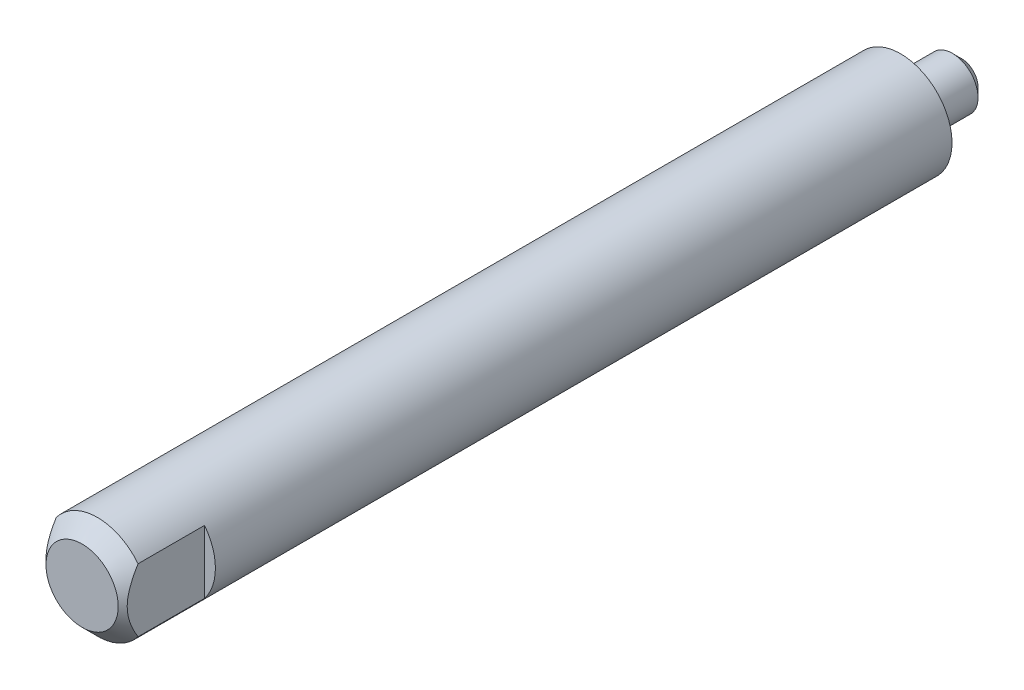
ISO-10303-21;
HEADER;
FILE_DESCRIPTION(('STEP AP214'),'2;1');
FILE_NAME('part.step','',(''),(''),'','','');
FILE_SCHEMA(('AUTOMOTIVE_DESIGN { 1 0 10303 214 1 1 1 1 }'));
ENDSEC;
DATA;
#1=APPLICATION_CONTEXT('core data for automotive mechanical design processes');
#2=APPLICATION_PROTOCOL_DEFINITION('international standard','automotive_design',2000,#1);
#3=PRODUCT_CONTEXT('',#1,'mechanical');
#4=PRODUCT('Part','Part','',(#3));
#5=PRODUCT_RELATED_PRODUCT_CATEGORY('part','',(#4));
#6=PRODUCT_DEFINITION_FORMATION('','',#4);
#7=PRODUCT_DEFINITION_CONTEXT('part definition',#1,'design');
#8=PRODUCT_DEFINITION('design','',#6,#7);
#9=PRODUCT_DEFINITION_SHAPE('','',#8);
#10=(LENGTH_UNIT() NAMED_UNIT(*) SI_UNIT(.MILLI.,.METRE.));
#11=(NAMED_UNIT(*) PLANE_ANGLE_UNIT() SI_UNIT($,.RADIAN.));
#12=(NAMED_UNIT(*) SI_UNIT($,.STERADIAN.) SOLID_ANGLE_UNIT());
#13=UNCERTAINTY_MEASURE_WITH_UNIT(LENGTH_MEASURE(1.E-05),#10,'distance_accuracy_value','');
#14=(GEOMETRIC_REPRESENTATION_CONTEXT(3) GLOBAL_UNCERTAINTY_ASSIGNED_CONTEXT((#13)) GLOBAL_UNIT_ASSIGNED_CONTEXT((#10,
#11,#12)) REPRESENTATION_CONTEXT('',''));
#15=CARTESIAN_POINT('',(0.,0.,0.));
#16=DIRECTION('',(0.,0.,1.));
#17=DIRECTION('',(1.,0.,0.));
#18=AXIS2_PLACEMENT_3D('',#15,#16,#17);
#19=CARTESIAN_POINT('',(5.1211434,-5.090754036,0.));
#20=DIRECTION('',(0.,0.,1.));
#21=DIRECTION('',(0.,1.,0.));
#22=AXIS2_PLACEMENT_3D('',#19,#20,#21);
#23=PLANE('',#22);
#24=CARTESIAN_POINT('',(0.,0.,0.));
#25=DIRECTION('',(0.,0.,1.));
#26=DIRECTION('',(1.,0.,0.));
#27=AXIS2_PLACEMENT_3D('',#24,#25,#26);
#28=CIRCLE('',#27,2.8);
#29=CARTESIAN_POINT('',(2.8,0.,0.));
#30=VERTEX_POINT('',#29);
#31=EDGE_CURVE('E129',#30,#30,#28,.T.);
#32=ORIENTED_EDGE('',*,*,#31,.T.);
#33=EDGE_LOOP('',(#32));
#34=FACE_BOUND('',#33,.T.);
#35=CARTESIAN_POINT('',(0.0303893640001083,0.,0.));
#36=DIRECTION('',(0.,0.,-1.));
#37=DIRECTION('',(1.,0.,0.));
#38=AXIS2_PLACEMENT_3D('',#35,#36,#37);
#39=CIRCLE('',#38,5.030389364);
#40=CARTESIAN_POINT('',(5.06077872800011,0.,0.));
#41=VERTEX_POINT('',#40);
#42=EDGE_CURVE('E81',#41,#41,#39,.F.);
#43=ORIENTED_EDGE('',*,*,#42,.F.);
#44=EDGE_LOOP('',(#43));
#45=FACE_BOUND('',#44,.T.);
#46=ADVANCED_FACE('F14',(#34,#45),#23,.F.);
#47=CARTESIAN_POINT('',(3.6031434,3.572754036,80.));
#48=DIRECTION('',(0.,0.,-1.));
#49=DIRECTION('',(0.,-1.,0.));
#50=AXIS2_PLACEMENT_3D('',#47,#48,#49);
#51=PLANE('',#50);
#52=CARTESIAN_POINT('',(0.030389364,0.,80.));
#53=DIRECTION('',(0.,0.,-1.));
#54=DIRECTION('',(1.,0.,0.));
#55=AXIS2_PLACEMENT_3D('',#52,#53,#54);
#56=CIRCLE('',#55,3.53038936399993);
#57=CARTESIAN_POINT('',(3.56077872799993,0.,80.));
#58=VERTEX_POINT('',#57);
#59=EDGE_CURVE('E85',#58,#58,#56,.F.);
#60=ORIENTED_EDGE('',*,*,#59,.T.);
#61=EDGE_LOOP('',(#60));
#62=FACE_BOUND('',#61,.T.);
#63=ADVANCED_FACE('F110',(#62),#51,.F.);
#64=CARTESIAN_POINT('',(5.0671434,3.126901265,72.));
#65=DIRECTION('',(0.,0.,-1.));
#66=DIRECTION('',(0.,-1.,0.));
#67=AXIS2_PLACEMENT_3D('',#64,#65,#66);
#68=PLANE('',#67);
#69=CARTESIAN_POINT('',(0.030389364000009,0.,71.999999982));
#70=DIRECTION('',(0.,0.,-1.));
#71=DIRECTION('',(1.,0.,0.));
#72=AXIS2_PLACEMENT_3D('',#69,#70,#71);
#73=CIRCLE('',#72,5.030389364);
#74=CARTESIAN_POINT('',(3.99999999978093,-3.08982338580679,71.999999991));
#75=VERTEX_POINT('',#74);
#76=CARTESIAN_POINT('',(3.99999999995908,3.08982338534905,71.999999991));
#77=VERTEX_POINT('',#76);
#78=EDGE_CURVE('E54',#75,#77,#73,.F.);
#79=ORIENTED_EDGE('',*,*,#78,.T.);
#80=DIRECTION('',(0.,1.,0.));
#81=VECTOR('',#80,1.);
#82=CARTESIAN_POINT('',(4.,0.,72.));
#83=LINE('',#82,#81);
#84=EDGE_CURVE('E56',#75,#77,#83,.T.);
#85=ORIENTED_EDGE('',*,*,#84,.F.);
#86=EDGE_LOOP('',(#79,#85));
#87=FACE_BOUND('',#86,.T.);
#88=ADVANCED_FACE('F160',(#87),#68,.F.);
#89=CARTESIAN_POINT('',(4.,3.089823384,79.633815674));
#90=DIRECTION('',(1.,0.,0.));
#91=DIRECTION('',(0.,-1.,0.));
#92=AXIS2_PLACEMENT_3D('',#89,#90,#91);
#93=PLANE('',#92);
#94=DIRECTION('',(0.,0.,-1.));
#95=VECTOR('',#94,1.);
#96=CARTESIAN_POINT('',(3.99999999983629,3.0898233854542,39.25));
#97=LINE('',#96,#95);
#98=CARTESIAN_POINT('',(3.99999999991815,3.08982338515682,78.5000000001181));
#99=VERTEX_POINT('',#98);
#100=EDGE_CURVE('E72',#77,#99,#97,.F.);
#101=ORIENTED_EDGE('',*,*,#100,.T.);
#102=CARTESIAN_POINT('',(4.00000000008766,3.08982338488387,78.500000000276));
#103=CARTESIAN_POINT('',(4.00000000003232,3.01524521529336,78.5458033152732));
#104=CARTESIAN_POINT('',(4.00000000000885,2.94021166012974,78.5908640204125));
#105=CARTESIAN_POINT('',(3.99999999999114,2.78912389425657,78.679280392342));
#106=CARTESIAN_POINT('',(3.99999999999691,2.71306944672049,78.7226356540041));
#107=CARTESIAN_POINT('',(4.00000000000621,2.48267313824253,78.8501077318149));
#108=CARTESIAN_POINT('',(4.00000000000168,2.32667126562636,78.9312744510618));
#109=CARTESIAN_POINT('',(3.99999999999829,2.00639059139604,79.0848013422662));
#110=CARTESIAN_POINT('',(3.99999999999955,1.84200763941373,79.1569466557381));
#111=CARTESIAN_POINT('',(4.00000000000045,1.50780137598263,79.2868456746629));
#112=CARTESIAN_POINT('',(4.0000000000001,1.33798705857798,79.3446219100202));
#113=CARTESIAN_POINT('',(3.99999999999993,1.04971888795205,79.4258354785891));
#114=CARTESIAN_POINT('',(3.99999999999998,0.932689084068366,79.454320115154));
#115=CARTESIAN_POINT('',(4.00000000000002,0.696679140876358,79.5017639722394));
#116=CARTESIAN_POINT('',(4.,0.57769898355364,79.5207231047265));
#117=CARTESIAN_POINT('',(4.,0.339668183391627,79.5480098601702));
#118=CARTESIAN_POINT('',(4.,0.220629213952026,79.5564379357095));
#119=CARTESIAN_POINT('',(4.,-0.0177222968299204,79.5625270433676));
#120=CARTESIAN_POINT('',(4.,-0.137034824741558,79.5601885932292));
#121=CARTESIAN_POINT('',(4.,-0.374862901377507,79.5448831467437));
#122=CARTESIAN_POINT('',(4.,-0.493379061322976,79.5319255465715));
#123=CARTESIAN_POINT('',(4.,-0.728877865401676,79.496098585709));
#124=CARTESIAN_POINT('',(4.,-0.845860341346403,79.4732281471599));
#125=CARTESIAN_POINT('',(4.,-1.19570285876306,79.3908352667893));
#126=CARTESIAN_POINT('',(4.,-1.42540833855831,79.317693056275));
#127=CARTESIAN_POINT('',(4.,-1.77688352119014,79.1828307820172));
#128=CARTESIAN_POINT('',(4.,-1.90227100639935,79.1299074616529));
#129=CARTESIAN_POINT('',(4.,-2.15003443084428,79.0172629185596));
#130=CARTESIAN_POINT('',(4.,-2.27240926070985,78.9575392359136));
#131=CARTESIAN_POINT('',(4.,-2.51204634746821,78.8338140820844));
#132=CARTESIAN_POINT('',(4.,-2.62936141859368,78.7699135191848));
#133=CARTESIAN_POINT('',(4.,-2.86141123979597,78.6378957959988));
#134=CARTESIAN_POINT('',(4.,-2.97614897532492,78.5697838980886));
#135=CARTESIAN_POINT('',(4.,-3.08982338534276,78.4999999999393));
#136=B_SPLINE_CURVE_WITH_KNOTS('',3,(#102,#103,#104,#105,#106,#107,#108,#109,#110,#111,#112,
#113,#114,#115,#116,#117,#118,#119,#120,#121,#122,#123,#124,#125,#126,#127,#128,#129,#130,#131,
#132,#133,#134,#135),.UNSPECIFIED.,.F.,.F.,(4,2,2,2,2,2,2,2,2,2,2,2,2,2,2,2,4),(0.,
0.26255308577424,0.525168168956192,1.05242053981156,1.59049087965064,2.1277121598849,
2.48871610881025,2.84972339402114,3.20726017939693,3.56477977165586,3.92198335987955,
4.27922579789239,4.99980825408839,5.40797393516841,5.81628773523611,6.21696425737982,
6.61714984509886),.UNSPECIFIED.);
#137=CARTESIAN_POINT('',(3.99999999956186,-3.08982338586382,78.499999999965));
#138=VERTEX_POINT('',#137);
#139=EDGE_CURVE('E68',#99,#138,#136,.T.);
#140=ORIENTED_EDGE('',*,*,#139,.T.);
#141=DIRECTION('',(0.,0.,1.));
#142=VECTOR('',#141,1.);
#143=CARTESIAN_POINT('',(3.99999999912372,-3.08982338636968,39.25));
#144=LINE('',#143,#142);
#145=EDGE_CURVE('E84',#138,#75,#144,.F.);
#146=ORIENTED_EDGE('',*,*,#145,.T.);
#147=ORIENTED_EDGE('',*,*,#84,.T.);
#148=EDGE_LOOP('',(#101,#140,#146,#147));
#149=FACE_BOUND('',#148,.T.);
#150=ADVANCED_FACE('F154',(#149),#93,.T.);
#151=CARTESIAN_POINT('',(-4.,-3.046234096,72.));
#152=DIRECTION('',(0.,0.,1.));
#153=DIRECTION('',(0.,1.,0.));
#154=AXIS2_PLACEMENT_3D('',#151,#152,#153);
#155=PLANE('',#154);
#156=DIRECTION('',(0.,-1.,0.));
#157=VECTOR('',#156,1.);
#158=CARTESIAN_POINT('',(-4.,0.,72.));
#159=LINE('',#158,#157);
#160=CARTESIAN_POINT('',(-4.00000000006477,3.01011274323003,71.999999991));
#161=VERTEX_POINT('',#160);
#162=CARTESIAN_POINT('',(-3.99999999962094,-3.01011274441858,71.999999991));
#163=VERTEX_POINT('',#162);
#164=EDGE_CURVE('E62',#161,#163,#159,.T.);
#165=ORIENTED_EDGE('',*,*,#164,.F.);
#166=CARTESIAN_POINT('',(0.030389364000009,0.,71.999999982));
#167=DIRECTION('',(0.,0.,-1.));
#168=DIRECTION('',(1.,0.,0.));
#169=AXIS2_PLACEMENT_3D('',#166,#167,#168);
#170=CIRCLE('',#169,5.030389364);
#171=EDGE_CURVE('E66',#161,#163,#170,.F.);
#172=ORIENTED_EDGE('',*,*,#171,.T.);
#173=EDGE_LOOP('',(#165,#172));
#174=FACE_BOUND('',#173,.T.);
#175=ADVANCED_FACE('F64',(#174),#155,.T.);
#176=CARTESIAN_POINT('',(-4.,3.010112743,72.));
#177=DIRECTION('',(-1.,0.,0.));
#178=DIRECTION('',(0.,-1.,0.));
#179=AXIS2_PLACEMENT_3D('',#176,#177,#178);
#180=PLANE('',#179);
#181=DIRECTION('',(0.,0.,-1.));
#182=VECTOR('',#181,1.);
#183=CARTESIAN_POINT('',(-3.99999999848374,-3.01011274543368,39.25));
#184=LINE('',#183,#182);
#185=CARTESIAN_POINT('',(-3.99999999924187,-3.0101127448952,78.4999999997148));
#186=VERTEX_POINT('',#185);
#187=EDGE_CURVE('E31',#163,#186,#184,.F.);
#188=ORIENTED_EDGE('',*,*,#187,.T.);
#189=CARTESIAN_POINT('',(-3.99999999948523,-3.01011274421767,78.4999999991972));
#190=CARTESIAN_POINT('',(-3.99999999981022,-2.93602213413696,78.5443299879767));
#191=CARTESIAN_POINT('',(-3.99999999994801,-2.86147354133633,78.5878933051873));
#192=CARTESIAN_POINT('',(-4.000000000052,-2.71135486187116,78.6732645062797));
#193=CARTESIAN_POINT('',(-4.00000000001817,-2.63578452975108,78.715071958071));
#194=CARTESIAN_POINT('',(-3.99999999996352,-2.40686097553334,78.8378041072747));
#195=CARTESIAN_POINT('',(-3.99999999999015,-2.25185492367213,78.9156993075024));
#196=CARTESIAN_POINT('',(-4.00000000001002,-1.93411364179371,79.0622120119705));
#197=CARTESIAN_POINT('',(-4.00000000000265,-1.77128998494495,79.1306399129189));
#198=CARTESIAN_POINT('',(-3.99999999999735,-1.44045545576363,79.2530735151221));
#199=CARTESIAN_POINT('',(-3.99999999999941,-1.27245300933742,79.3071013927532));
#200=CARTESIAN_POINT('',(-4.00000000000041,-0.984493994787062,79.3830520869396));
#201=CARTESIAN_POINT('',(-4.00000000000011,-0.865794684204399,79.4097352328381));
#202=CARTESIAN_POINT('',(-3.99999999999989,-0.626573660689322,79.4532805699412));
#203=CARTESIAN_POINT('',(-3.99999999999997,-0.50605192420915,79.4701426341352));
#204=CARTESIAN_POINT('',(-4.00000000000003,-0.265044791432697,79.493059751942));
#205=CARTESIAN_POINT('',(-4.00000000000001,-0.144568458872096,79.4992088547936));
#206=CARTESIAN_POINT('',(-3.99999999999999,0.0964457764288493,79.5006475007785));
#207=CARTESIAN_POINT('',(-4.,0.21698367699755,79.4959374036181));
#208=CARTESIAN_POINT('',(-4.,0.456922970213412,79.4759412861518));
#209=CARTESIAN_POINT('',(-4.,0.576326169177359,79.4606766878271));
#210=CARTESIAN_POINT('',(-4.,0.813448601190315,79.4203937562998));
#211=CARTESIAN_POINT('',(-4.,0.931167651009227,79.3953743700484));
#212=CARTESIAN_POINT('',(-4.,1.28286982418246,79.3068746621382));
#213=CARTESIAN_POINT('',(-4.,1.51356891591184,79.2301335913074));
#214=CARTESIAN_POINT('',(-4.,1.85028378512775,79.0967576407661));
#215=CARTESIAN_POINT('',(-4.,1.96032586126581,79.0495954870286));
#216=CARTESIAN_POINT('',(-4.,2.1781072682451,78.9501246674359));
#217=CARTESIAN_POINT('',(-4.,2.2858462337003,78.8978151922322));
#218=CARTESIAN_POINT('',(-4.,2.49745233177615,78.7898051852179));
#219=CARTESIAN_POINT('',(-4.,2.6013537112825,78.7341709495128));
#220=CARTESIAN_POINT('',(-4.,2.80715923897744,78.619488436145));
#221=CARTESIAN_POINT('',(-4.,2.90906479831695,78.5604426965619));
#222=CARTESIAN_POINT('',(-4.,3.01011274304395,78.5000000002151));
#223=B_SPLINE_CURVE_WITH_KNOTS('',3,(#189,#190,#191,#192,#193,#194,#195,#196,#197,#198,#199,
#200,#201,#202,#203,#204,#205,#206,#207,#208,#209,#210,#211,#212,#213,#214,#215,#216,#217,#218,
#219,#220,#221,#222),.UNSPECIFIED.,.F.,.F.,(4,2,2,2,2,2,2,2,2,2,2,2,2,2,2,2,4),(0.,
0.259010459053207,0.518084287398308,1.03819340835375,1.56755097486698,2.09608854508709,
2.46071878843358,2.82535374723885,3.18677112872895,3.54817653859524,3.90885056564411,
4.26956353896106,4.99644414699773,5.35554865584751,5.71470971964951,6.06822034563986,
6.42147127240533),.UNSPECIFIED.);
#224=CARTESIAN_POINT('',(-4.00000000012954,3.01011274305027,78.5000000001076));
#225=VERTEX_POINT('',#224);
#226=EDGE_CURVE('E67',#186,#225,#223,.T.);
#227=ORIENTED_EDGE('',*,*,#226,.T.);
#228=DIRECTION('',(0.,0.,1.));
#229=VECTOR('',#228,1.);
#230=CARTESIAN_POINT('',(-4.00000000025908,3.01011274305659,39.25));
#231=LINE('',#230,#229);
#232=EDGE_CURVE('E70',#225,#161,#231,.F.);
#233=ORIENTED_EDGE('',*,*,#232,.T.);
#234=ORIENTED_EDGE('',*,*,#164,.T.);
#235=EDGE_LOOP('',(#188,#227,#233,#234));
#236=FACE_BOUND('',#235,.T.);
#237=ADVANCED_FACE('F71',(#236),#180,.T.);
#238=CARTESIAN_POINT('',(0.030389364,0.,80.));
#239=DIRECTION('',(0.,0.,-1.));
#240=DIRECTION('',(1.,0.,0.));
#241=AXIS2_PLACEMENT_3D('',#238,#239,#240);
#242=CONICAL_SURFACE('',#241,3.530389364,0.785398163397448);
#243=CARTESIAN_POINT('',(0.030389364,0.,78.5));
#244=DIRECTION('',(0.,0.,-1.));
#245=DIRECTION('',(0.,-1.,0.));
#246=AXIS2_PLACEMENT_3D('',#243,#244,#245);
#247=CIRCLE('',#246,5.030389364);
#248=EDGE_CURVE('E77',#186,#138,#247,.F.);
#249=ORIENTED_EDGE('',*,*,#248,.T.);
#250=ORIENTED_EDGE('',*,*,#139,.F.);
#251=CARTESIAN_POINT('',(0.030389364,0.,78.5));
#252=DIRECTION('',(0.,0.,-1.));
#253=DIRECTION('',(0.,-1.,0.));
#254=AXIS2_PLACEMENT_3D('',#251,#252,#253);
#255=CIRCLE('',#254,5.030389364);
#256=EDGE_CURVE('E47',#99,#225,#255,.F.);
#257=ORIENTED_EDGE('',*,*,#256,.T.);
#258=ORIENTED_EDGE('',*,*,#226,.F.);
#259=EDGE_LOOP('',(#249,#250,#257,#258));
#260=FACE_BOUND('',#259,.T.);
#261=ORIENTED_EDGE('',*,*,#59,.F.);
#262=EDGE_LOOP('',(#261));
#263=FACE_BOUND('',#262,.T.);
#264=ADVANCED_FACE('F101',(#260,#263),#242,.T.);
#265=CARTESIAN_POINT('',(0.030389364,0.,78.5));
#266=DIRECTION('',(0.,0.,-1.));
#267=DIRECTION('',(1.,0.,0.));
#268=AXIS2_PLACEMENT_3D('',#265,#266,#267);
#269=CYLINDRICAL_SURFACE('',#268,5.030389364);
#270=ORIENTED_EDGE('',*,*,#42,.T.);
#271=EDGE_LOOP('',(#270));
#272=FACE_BOUND('',#271,.T.);
#273=ORIENTED_EDGE('',*,*,#256,.F.);
#274=ORIENTED_EDGE('',*,*,#100,.F.);
#275=ORIENTED_EDGE('',*,*,#78,.F.);
#276=ORIENTED_EDGE('',*,*,#145,.F.);
#277=ORIENTED_EDGE('',*,*,#248,.F.);
#278=ORIENTED_EDGE('',*,*,#187,.F.);
#279=ORIENTED_EDGE('',*,*,#171,.F.);
#280=ORIENTED_EDGE('',*,*,#232,.F.);
#281=EDGE_LOOP('',(#273,#274,#275,#276,#277,#278,#279,#280));
#282=FACE_BOUND('',#281,.T.);
#283=ADVANCED_FACE('F74',(#272,#282),#269,.T.);
#284=CARTESIAN_POINT('',(0.,0.,-6.));
#285=DIRECTION('',(0.,0.,1.));
#286=DIRECTION('',(1.,0.,0.));
#287=AXIS2_PLACEMENT_3D('',#284,#285,#286);
#288=CYLINDRICAL_SURFACE('',#287,2.5);
#289=CARTESIAN_POINT('',(0.,0.,-5.1));
#290=DIRECTION('',(0.,0.,-1.));
#291=DIRECTION('',(-1.,0.,0.));
#292=AXIS2_PLACEMENT_3D('',#289,#290,#291);
#293=CIRCLE('',#292,2.5);
#294=CARTESIAN_POINT('',(-2.5,0.,-5.1));
#295=VERTEX_POINT('',#294);
#296=EDGE_CURVE('E9',#295,#295,#293,.F.);
#297=ORIENTED_EDGE('',*,*,#296,.T.);
#298=EDGE_LOOP('',(#297));
#299=FACE_BOUND('',#298,.T.);
#300=CARTESIAN_POINT('',(0.,0.,-0.3));
#301=DIRECTION('',(0.,0.,1.));
#302=DIRECTION('',(1.,0.,0.));
#303=AXIS2_PLACEMENT_3D('',#300,#301,#302);
#304=CIRCLE('',#303,2.5);
#305=CARTESIAN_POINT('',(2.5,0.,-0.3));
#306=VERTEX_POINT('',#305);
#307=EDGE_CURVE('E132',#306,#306,#304,.F.);
#308=ORIENTED_EDGE('',*,*,#307,.T.);
#309=EDGE_LOOP('',(#308));
#310=FACE_BOUND('',#309,.T.);
#311=ADVANCED_FACE('F123',(#299,#310),#288,.T.);
#312=CARTESIAN_POINT('',(0.,0.,-6.));
#313=DIRECTION('',(0.,0.,-1.));
#314=DIRECTION('',(-1.,0.,0.));
#315=AXIS2_PLACEMENT_3D('',#312,#313,#314);
#316=PLANE('',#315);
#317=CARTESIAN_POINT('',(0.,0.,-6.));
#318=DIRECTION('',(0.,0.,-1.));
#319=DIRECTION('',(-1.,0.,0.));
#320=AXIS2_PLACEMENT_3D('',#317,#318,#319);
#321=CIRCLE('',#320,1.59999999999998);
#322=CARTESIAN_POINT('',(-1.59999999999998,0.,-6.));
#323=VERTEX_POINT('',#322);
#324=EDGE_CURVE('E23',#323,#323,#321,.T.);
#325=ORIENTED_EDGE('',*,*,#324,.T.);
#326=EDGE_LOOP('',(#325));
#327=FACE_BOUND('',#326,.T.);
#328=ADVANCED_FACE('F114',(#327),#316,.T.);
#329=CARTESIAN_POINT('',(0.,0.,-0.3));
#330=DIRECTION('',(0.,0.,1.));
#331=DIRECTION('',(1.,0.,0.));
#332=AXIS2_PLACEMENT_3D('',#329,#330,#331);
#333=TOROIDAL_SURFACE('',#332,2.8,0.3);
#334=ORIENTED_EDGE('',*,*,#31,.F.);
#335=EDGE_LOOP('',(#334));
#336=FACE_BOUND('',#335,.T.);
#337=ORIENTED_EDGE('',*,*,#307,.F.);
#338=EDGE_LOOP('',(#337));
#339=FACE_BOUND('',#338,.T.);
#340=ADVANCED_FACE('F112',(#336,#339),#333,.F.);
#341=CARTESIAN_POINT('',(0.,0.,-6.));
#342=DIRECTION('',(0.,0.,1.));
#343=DIRECTION('',(1.,0.,0.));
#344=AXIS2_PLACEMENT_3D('',#341,#342,#343);
#345=CONICAL_SURFACE('',#344,1.59999999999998,0.785398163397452);
#346=ORIENTED_EDGE('',*,*,#296,.F.);
#347=EDGE_LOOP('',(#346));
#348=FACE_BOUND('',#347,.T.);
#349=ORIENTED_EDGE('',*,*,#324,.F.);
#350=EDGE_LOOP('',(#349));
#351=FACE_BOUND('',#350,.T.);
#352=ADVANCED_FACE('F16',(#348,#351),#345,.T.);
#353=CLOSED_SHELL('',(#46,#63,#88,#150,#175,#237,#264,#283,#311,#328,#340,#352));
#354=MANIFOLD_SOLID_BREP('B1',#353);
#355=ADVANCED_BREP_SHAPE_REPRESENTATION('',(#18,#354),#14);
#356=SHAPE_DEFINITION_REPRESENTATION(#9,#355);
ENDSEC;
END-ISO-10303-21;
